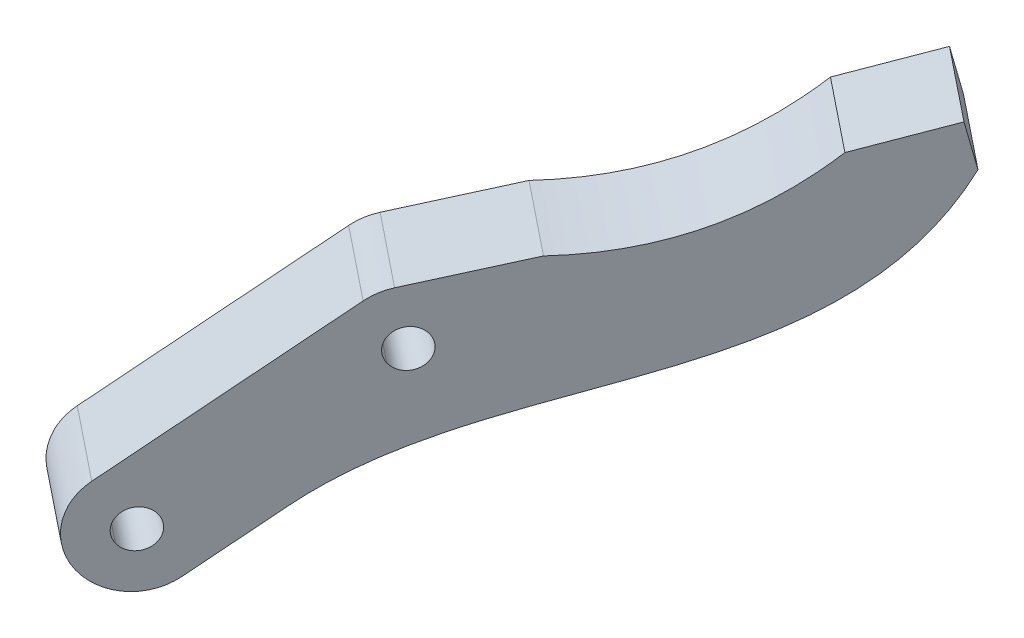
ISO-10303-21;
HEADER;
FILE_DESCRIPTION(('STEP AP214'),'2;1');
FILE_NAME('part.step','',(''),(''),'','','');
FILE_SCHEMA(('AUTOMOTIVE_DESIGN { 1 0 10303 214 1 1 1 1 }'));
ENDSEC;
DATA;
#1=APPLICATION_CONTEXT('core data for automotive mechanical design processes');
#2=APPLICATION_PROTOCOL_DEFINITION('international standard','automotive_design',2000,#1);
#3=PRODUCT_CONTEXT('',#1,'mechanical');
#4=PRODUCT('Part','Part','',(#3));
#5=PRODUCT_RELATED_PRODUCT_CATEGORY('part','',(#4));
#6=PRODUCT_DEFINITION_FORMATION('','',#4);
#7=PRODUCT_DEFINITION_CONTEXT('part definition',#1,'design');
#8=PRODUCT_DEFINITION('design','',#6,#7);
#9=PRODUCT_DEFINITION_SHAPE('','',#8);
#10=(LENGTH_UNIT() NAMED_UNIT(*) SI_UNIT(.MILLI.,.METRE.));
#11=(NAMED_UNIT(*) PLANE_ANGLE_UNIT() SI_UNIT($,.RADIAN.));
#12=(NAMED_UNIT(*) SI_UNIT($,.STERADIAN.) SOLID_ANGLE_UNIT());
#13=UNCERTAINTY_MEASURE_WITH_UNIT(LENGTH_MEASURE(1.E-05),#10,'distance_accuracy_value','');
#14=(GEOMETRIC_REPRESENTATION_CONTEXT(3) GLOBAL_UNCERTAINTY_ASSIGNED_CONTEXT((#13)) GLOBAL_UNIT_ASSIGNED_CONTEXT((#10,
#11,#12)) REPRESENTATION_CONTEXT('',''));
#15=CARTESIAN_POINT('',(0.,0.,0.));
#16=DIRECTION('',(0.,0.,1.));
#17=DIRECTION('',(1.,0.,0.));
#18=AXIS2_PLACEMENT_3D('',#15,#16,#17);
#19=CARTESIAN_POINT('',(239.431291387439,-64.0616310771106,155.644852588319));
#20=CARTESIAN_POINT('',(232.792104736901,-64.0241873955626,150.337329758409));
#21=CARTESIAN_POINT('',(233.603203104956,-81.6090432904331,162.811421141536));
#22=CARTESIAN_POINT('',(226.964016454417,-81.5715996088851,157.503898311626));
#23=CARTESIAN_POINT('',(220.015722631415,-77.0413137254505,179.840241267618));
#24=CARTESIAN_POINT('',(213.376535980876,-77.0038700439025,174.532718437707));
#25=CARTESIAN_POINT('',(211.23567759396,-87.3072541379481,190.750785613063));
#26=CARTESIAN_POINT('',(204.596490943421,-87.2698104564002,185.443262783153));
#27=(BOUNDED_SURFACE() B_SPLINE_SURFACE(3,1,((#19,#20),(#21,#22),(#23,#24),(#25,#26)),
.UNSPECIFIED.,.F.,.F.,.F.) B_SPLINE_SURFACE_WITH_KNOTS((4,4),(2,2),(0.,1.),(0.,1.),
.UNSPECIFIED.) GEOMETRIC_REPRESENTATION_ITEM() RATIONAL_B_SPLINE_SURFACE(((1.,1.),(1.,1.),(1.,
1.),(1.,1.))) REPRESENTATION_ITEM('') SURFACE());
#28=CARTESIAN_POINT('',(232.792104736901,-64.0241873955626,150.337329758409));
#29=CARTESIAN_POINT('',(226.964016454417,-81.5715996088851,157.503898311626));
#30=CARTESIAN_POINT('',(213.376535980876,-77.0038700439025,174.532718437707));
#31=CARTESIAN_POINT('',(204.596490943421,-87.2698104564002,185.443262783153));
#32=(BOUNDED_CURVE() B_SPLINE_CURVE(3,(#28,#29,#30,#31),.UNSPECIFIED.,.F.,
.F.) B_SPLINE_CURVE_WITH_KNOTS((4,4),(0.,1.),
.UNSPECIFIED.) CURVE() GEOMETRIC_REPRESENTATION_ITEM() RATIONAL_B_SPLINE_CURVE((1.,1.,1.,1.)) REPRESENTATION_ITEM(''));
#33=CARTESIAN_POINT('',(232.792104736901,-64.0241873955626,150.337329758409));
#34=VERTEX_POINT('',#33);
#35=CARTESIAN_POINT('',(204.596490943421,-87.2698104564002,185.443262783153));
#36=VERTEX_POINT('',#35);
#37=EDGE_CURVE('E292',#34,#36,#32,.T.);
#38=DIRECTION('',(-0.781080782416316,0.00440513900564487,-0.624414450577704));
#39=VECTOR('',#38,1.);
#40=CARTESIAN_POINT('',(239.431291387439,-64.0616310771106,155.644852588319));
#41=LINE('',#40,#39);
#42=CARTESIAN_POINT('',(239.431291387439,-64.0616310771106,155.644852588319));
#43=VERTEX_POINT('',#42);
#44=EDGE_CURVE('E189',#43,#34,#41,.T.);
#45=CARTESIAN_POINT('',(239.431291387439,-64.0616310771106,155.644852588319));
#46=CARTESIAN_POINT('',(233.603203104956,-81.6090432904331,162.811421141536));
#47=CARTESIAN_POINT('',(220.015722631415,-77.0413137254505,179.840241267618));
#48=CARTESIAN_POINT('',(211.23567759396,-87.3072541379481,190.750785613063));
#49=(BOUNDED_CURVE() B_SPLINE_CURVE(3,(#45,#46,#47,#48),.UNSPECIFIED.,.F.,
.F.) B_SPLINE_CURVE_WITH_KNOTS((4,4),(0.,1.),
.UNSPECIFIED.) CURVE() GEOMETRIC_REPRESENTATION_ITEM() RATIONAL_B_SPLINE_CURVE((1.,1.,1.,1.)) REPRESENTATION_ITEM(''));
#50=CARTESIAN_POINT('',(211.23567759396,-87.3072541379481,190.750785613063));
#51=VERTEX_POINT('',#50);
#52=EDGE_CURVE('E297',#43,#51,#49,.T.);
#53=DIRECTION('',(-0.781080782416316,0.00440513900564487,-0.624414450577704));
#54=VECTOR('',#53,1.);
#55=CARTESIAN_POINT('',(211.23567759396,-87.3072541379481,190.750785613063));
#56=LINE('',#55,#54);
#57=EDGE_CURVE('E246',#51,#36,#56,.T.);
#58=ORIENTED_EDGE('',*,*,#37,.F.);
#59=ORIENTED_EDGE('',*,*,#44,.F.);
#60=ORIENTED_EDGE('',*,*,#52,.T.);
#61=ORIENTED_EDGE('',*,*,#57,.T.);
#62=EDGE_LOOP('',(#58,#59,#60,#61));
#63=FACE_BOUND('',#62,.T.);
#64=ADVANCED_FACE('F17',(#63),#27,.T.);
#65=CARTESIAN_POINT('',(199.309984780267,-75.2439494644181,205.753753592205));
#66=DIRECTION('',(-0.108750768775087,0.98373318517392,0.142976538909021));
#67=DIRECTION('',(0.614887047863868,0.179581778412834,-0.767896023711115));
#68=AXIS2_PLACEMENT_3D('',#65,#66,#67);
#69=PLANE('',#68);
#70=DIRECTION('',(0.614887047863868,0.179581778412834,-0.767896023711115));
#71=VECTOR('',#70,1.);
#72=CARTESIAN_POINT('',(192.670798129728,-75.2065057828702,200.446230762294));
#73=LINE('',#72,#71);
#74=CARTESIAN_POINT('',(208.948301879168,-70.4525544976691,180.118220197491));
#75=VERTEX_POINT('',#74);
#76=CARTESIAN_POINT('',(215.032810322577,-68.6755340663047,172.519637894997));
#77=VERTEX_POINT('',#76);
#78=EDGE_CURVE('E191',#75,#77,#73,.T.);
#79=ORIENTED_EDGE('',*,*,#78,.F.);
#80=DIRECTION('',(-0.781080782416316,0.00440513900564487,-0.624414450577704));
#81=VECTOR('',#80,1.);
#82=CARTESIAN_POINT('',(215.587488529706,-70.4899981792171,185.425743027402));
#83=LINE('',#82,#81);
#84=CARTESIAN_POINT('',(215.587488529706,-70.4899981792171,185.425743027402));
#85=VERTEX_POINT('',#84);
#86=EDGE_CURVE('E201',#85,#75,#83,.T.);
#87=ORIENTED_EDGE('',*,*,#86,.F.);
#88=DIRECTION('',(0.614887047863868,0.179581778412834,-0.767896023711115));
#89=VECTOR('',#88,1.);
#90=CARTESIAN_POINT('',(199.309984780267,-75.2439494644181,205.753753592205));
#91=LINE('',#90,#89);
#92=CARTESIAN_POINT('',(221.671996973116,-68.7129777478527,177.827160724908));
#93=VERTEX_POINT('',#92);
#94=EDGE_CURVE('E320',#85,#93,#91,.T.);
#95=ORIENTED_EDGE('',*,*,#94,.T.);
#96=DIRECTION('',(-0.781080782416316,0.00440513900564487,-0.624414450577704));
#97=VECTOR('',#96,1.);
#98=CARTESIAN_POINT('',(221.671996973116,-68.7129777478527,177.827160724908));
#99=LINE('',#98,#97);
#100=EDGE_CURVE('E10',#93,#77,#99,.T.);
#101=ORIENTED_EDGE('',*,*,#100,.T.);
#102=EDGE_LOOP('',(#79,#87,#95,#101));
#103=FACE_BOUND('',#102,.T.);
#104=ADVANCED_FACE('F19',(#103),#69,.T.);
#105=CARTESIAN_POINT('',(221.671996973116,-68.7129777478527,177.827160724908));
#106=CARTESIAN_POINT('',(215.032810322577,-68.6755340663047,172.519637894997));
#107=CARTESIAN_POINT('',(228.667968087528,-69.2652196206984,169.071996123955));
#108=CARTESIAN_POINT('',(222.028781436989,-69.2277759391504,163.764473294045));
#109=CARTESIAN_POINT('',(234.002933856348,-62.0056545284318,162.449696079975));
#110=CARTESIAN_POINT('',(227.363747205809,-61.9682108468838,157.142173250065));
#111=(BOUNDED_SURFACE() B_SPLINE_SURFACE(2,1,((#105,#106),(#107,#108),(#109,#110)),
.UNSPECIFIED.,.F.,.F.,.F.) B_SPLINE_SURFACE_WITH_KNOTS((3,3),(2,2),(0.,1.),(0.,1.),
.UNSPECIFIED.) GEOMETRIC_REPRESENTATION_ITEM() RATIONAL_B_SPLINE_SURFACE(((1.,1.),(1.,1.),(1.,1.))) REPRESENTATION_ITEM('') SURFACE());
#112=CARTESIAN_POINT('',(215.032810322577,-68.6755340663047,172.519637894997));
#113=CARTESIAN_POINT('',(222.028781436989,-69.2277759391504,163.764473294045));
#114=CARTESIAN_POINT('',(227.363747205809,-61.9682108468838,157.142173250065));
#115=(BOUNDED_CURVE() B_SPLINE_CURVE(2,(#112,#113,#114),.UNSPECIFIED.,.F.,
.F.) B_SPLINE_CURVE_WITH_KNOTS((3,3),(0.,1.),
.UNSPECIFIED.) CURVE() GEOMETRIC_REPRESENTATION_ITEM() RATIONAL_B_SPLINE_CURVE((1.,1.,1.)) REPRESENTATION_ITEM(''));
#116=CARTESIAN_POINT('',(227.363747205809,-61.9682108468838,157.142173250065));
#117=VERTEX_POINT('',#116);
#118=EDGE_CURVE('E195',#77,#117,#115,.T.);
#119=CARTESIAN_POINT('',(221.671996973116,-68.7129777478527,177.827160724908));
#120=CARTESIAN_POINT('',(228.667968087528,-69.2652196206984,169.071996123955));
#121=CARTESIAN_POINT('',(234.002933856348,-62.0056545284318,162.449696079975));
#122=(BOUNDED_CURVE() B_SPLINE_CURVE(2,(#119,#120,#121),.UNSPECIFIED.,.F.,
.F.) B_SPLINE_CURVE_WITH_KNOTS((3,3),(0.,1.),
.UNSPECIFIED.) CURVE() GEOMETRIC_REPRESENTATION_ITEM() RATIONAL_B_SPLINE_CURVE((1.,1.,1.)) REPRESENTATION_ITEM(''));
#123=CARTESIAN_POINT('',(234.002933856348,-62.0056545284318,162.449696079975));
#124=VERTEX_POINT('',#123);
#125=EDGE_CURVE('E315',#93,#124,#122,.T.);
#126=DIRECTION('',(-0.781080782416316,0.00440513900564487,-0.624414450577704));
#127=VECTOR('',#126,1.);
#128=CARTESIAN_POINT('',(234.002933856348,-62.0056545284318,162.449696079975));
#129=LINE('',#128,#127);
#130=EDGE_CURVE('E26',#124,#117,#129,.T.);
#131=ORIENTED_EDGE('',*,*,#118,.F.);
#132=ORIENTED_EDGE('',*,*,#100,.F.);
#133=ORIENTED_EDGE('',*,*,#125,.T.);
#134=ORIENTED_EDGE('',*,*,#130,.T.);
#135=EDGE_LOOP('',(#131,#132,#133,#134));
#136=FACE_BOUND('',#135,.T.);
#137=ADVANCED_FACE('F368',(#136),#111,.T.);
#138=CARTESIAN_POINT('',(198.907540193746,-75.2494675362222,206.257133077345));
#139=DIRECTION('',(-0.140042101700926,0.973266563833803,0.182045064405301));
#140=DIRECTION('',(0.60852364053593,0.229636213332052,-0.759582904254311));
#141=AXIS2_PLACEMENT_3D('',#138,#139,#140);
#142=PLANE('',#141);
#143=DIRECTION('',(0.60852364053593,0.229636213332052,-0.759582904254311));
#144=VECTOR('',#143,1.);
#145=CARTESIAN_POINT('',(192.268353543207,-75.2120238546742,200.949610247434));
#146=LINE('',#145,#144);
#147=CARTESIAN_POINT('',(232.231936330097,-60.1311211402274,151.06551001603));
#148=VERTEX_POINT('',#147);
#149=EDGE_CURVE('E259',#117,#148,#146,.T.);
#150=ORIENTED_EDGE('',*,*,#149,.F.);
#151=ORIENTED_EDGE('',*,*,#130,.F.);
#152=DIRECTION('',(0.60852364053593,0.229636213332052,-0.759582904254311));
#153=VECTOR('',#152,1.);
#154=CARTESIAN_POINT('',(198.907540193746,-75.2494675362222,206.257133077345));
#155=LINE('',#154,#153);
#156=CARTESIAN_POINT('',(238.871122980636,-60.1685648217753,156.373032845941));
#157=VERTEX_POINT('',#156);
#158=EDGE_CURVE('E312',#124,#157,#155,.T.);
#159=ORIENTED_EDGE('',*,*,#158,.T.);
#160=DIRECTION('',(-0.781080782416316,0.00440513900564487,-0.624414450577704));
#161=VECTOR('',#160,1.);
#162=CARTESIAN_POINT('',(238.871122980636,-60.1685648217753,156.373032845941));
#163=LINE('',#162,#161);
#164=EDGE_CURVE('E326',#157,#148,#163,.T.);
#165=ORIENTED_EDGE('',*,*,#164,.T.);
#166=EDGE_LOOP('',(#150,#151,#159,#165));
#167=FACE_BOUND('',#166,.T.);
#168=ADVANCED_FACE('F341',(#167),#142,.T.);
#169=CARTESIAN_POINT('',(240.610641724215,-72.2578965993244,154.111778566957));
#170=DIRECTION('',(0.60852364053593,0.229636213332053,-0.759582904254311));
#171=DIRECTION('',(0.781080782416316,-0.00440513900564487,0.624414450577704));
#172=AXIS2_PLACEMENT_3D('',#169,#170,#171);
#173=PLANE('',#172);
#174=DIRECTION('',(0.140042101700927,-0.973266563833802,-0.182045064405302));
#175=VECTOR('',#174,1.);
#176=CARTESIAN_POINT('',(233.971455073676,-72.2204529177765,148.804255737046));
#177=LINE('',#176,#175);
#178=EDGE_CURVE('E263',#148,#34,#177,.T.);
#179=ORIENTED_EDGE('',*,*,#178,.F.);
#180=ORIENTED_EDGE('',*,*,#164,.F.);
#181=DIRECTION('',(0.140042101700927,-0.973266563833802,-0.182045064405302));
#182=VECTOR('',#181,1.);
#183=CARTESIAN_POINT('',(240.610641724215,-72.2578965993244,154.111778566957));
#184=LINE('',#183,#182);
#185=EDGE_CURVE('E305',#157,#43,#184,.T.);
#186=ORIENTED_EDGE('',*,*,#185,.T.);
#187=ORIENTED_EDGE('',*,*,#44,.T.);
#188=EDGE_LOOP('',(#179,#180,#186,#187));
#189=FACE_BOUND('',#188,.T.);
#190=ADVANCED_FACE('F334',(#189),#173,.T.);
#191=CARTESIAN_POINT('',(200.647058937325,-87.3387993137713,203.995878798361));
#192=DIRECTION('',(-0.781080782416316,0.00440513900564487,-0.624414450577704));
#193=DIRECTION('',(0.366392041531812,-0.806505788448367,-0.464010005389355));
#194=AXIS2_PLACEMENT_3D('',#191,#192,#193);
#195=PLANE('',#194);
#196=CARTESIAN_POINT('',(216.131242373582,-75.4086641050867,184.710860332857));
#197=DIRECTION('',(-0.781080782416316,0.00440513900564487,-0.624414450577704));
#198=DIRECTION('',(0.505637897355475,0.591209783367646,-0.628332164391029));
#199=AXIS2_PLACEMENT_3D('',#196,#197,#198);
#200=CIRCLE('',#199,1.75);
#201=CARTESIAN_POINT('',(215.24637605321,-76.4432812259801,185.810441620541));
#202=VERTEX_POINT('',#201);
#203=CARTESIAN_POINT('',(217.016108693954,-74.3740469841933,183.611279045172));
#204=VERTEX_POINT('',#203);
#205=EDGE_CURVE('E172',#202,#204,#200,.T.);
#206=ORIENTED_EDGE('',*,*,#205,.T.);
#207=CARTESIAN_POINT('',(216.131242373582,-75.4086641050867,184.710860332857));
#208=DIRECTION('',(-0.781080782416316,0.00440513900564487,-0.624414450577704));
#209=DIRECTION('',(0.505637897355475,0.591209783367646,-0.628332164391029));
#210=AXIS2_PLACEMENT_3D('',#207,#208,#209);
#211=CIRCLE('',#210,1.75);
#212=EDGE_CURVE('E165',#204,#202,#211,.T.);
#213=ORIENTED_EDGE('',*,*,#212,.T.);
#214=EDGE_LOOP('',(#206,#213));
#215=FACE_BOUND('',#214,.T.);
#216=CARTESIAN_POINT('',(205.007208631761,-88.4152793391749,198.534167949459));
#217=DIRECTION('',(-0.781080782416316,0.00440513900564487,-0.624414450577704));
#218=DIRECTION('',(0.505637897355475,0.591209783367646,-0.628332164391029));
#219=AXIS2_PLACEMENT_3D('',#216,#217,#218);
#220=CIRCLE('',#219,1.75);
#221=CARTESIAN_POINT('',(204.122342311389,-89.4498964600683,199.633749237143));
#222=VERTEX_POINT('',#221);
#223=CARTESIAN_POINT('',(205.892074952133,-87.3806622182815,197.434586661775));
#224=VERTEX_POINT('',#223);
#225=EDGE_CURVE('E220',#222,#224,#220,.T.);
#226=ORIENTED_EDGE('',*,*,#225,.T.);
#227=CARTESIAN_POINT('',(205.007208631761,-88.4152793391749,198.534167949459));
#228=DIRECTION('',(-0.781080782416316,0.00440513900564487,-0.624414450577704));
#229=DIRECTION('',(0.505637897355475,0.591209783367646,-0.628332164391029));
#230=AXIS2_PLACEMENT_3D('',#227,#228,#229);
#231=CIRCLE('',#230,1.75);
#232=EDGE_CURVE('E166',#224,#222,#231,.T.);
#233=ORIENTED_EDGE('',*,*,#232,.T.);
#234=EDGE_LOOP('',(#226,#233));
#235=FACE_BOUND('',#234,.T.);
#236=DIRECTION('',(0.505637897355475,0.591209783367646,-0.628332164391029));
#237=VECTOR('',#236,1.);
#238=CARTESIAN_POINT('',(204.310979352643,-95.403857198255,199.355778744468));
#239=LINE('',#238,#237);
#240=CARTESIAN_POINT('',(206.83916883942,-92.4478082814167,196.214117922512));
#241=VERTEX_POINT('',#240);
#242=EDGE_CURVE('E250',#241,#51,#239,.T.);
#243=ORIENTED_EDGE('',*,*,#242,.T.);
#244=ORIENTED_EDGE('',*,*,#52,.F.);
#245=ORIENTED_EDGE('',*,*,#185,.F.);
#246=ORIENTED_EDGE('',*,*,#158,.F.);
#247=ORIENTED_EDGE('',*,*,#125,.F.);
#248=ORIENTED_EDGE('',*,*,#94,.F.);
#249=CARTESIAN_POINT('',(216.131242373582,-75.4086641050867,184.710860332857));
#250=DIRECTION('',(-0.781080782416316,0.00440513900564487,-0.624414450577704));
#251=DIRECTION('',(0.505637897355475,0.591209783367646,-0.628332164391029));
#252=AXIS2_PLACEMENT_3D('',#249,#250,#251);
#253=CIRCLE('',#252,5.);
#254=CARTESIAN_POINT('',(214.299282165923,-71.3761351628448,187.030910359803));
#255=VERTEX_POINT('',#254);
#256=EDGE_CURVE('E187',#255,#85,#253,.T.);
#257=ORIENTED_EDGE('',*,*,#256,.F.);
#258=DIRECTION('',(0.505637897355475,0.591209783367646,-0.628332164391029));
#259=VECTOR('',#258,1.);
#260=CARTESIAN_POINT('',(200.647058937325,-87.3387993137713,203.995878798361));
#261=LINE('',#260,#259);
#262=CARTESIAN_POINT('',(203.175248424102,-84.382750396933,200.854217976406));
#263=VERTEX_POINT('',#262);
#264=EDGE_CURVE('E225',#263,#255,#261,.T.);
#265=ORIENTED_EDGE('',*,*,#264,.F.);
#266=CARTESIAN_POINT('',(205.007208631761,-88.4152793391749,198.534167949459));
#267=DIRECTION('',(-0.781080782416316,0.00440513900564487,-0.624414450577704));
#268=DIRECTION('',(0.505637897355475,0.591209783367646,-0.628332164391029));
#269=AXIS2_PLACEMENT_3D('',#266,#267,#268);
#270=CIRCLE('',#269,5.);
#271=CARTESIAN_POINT('',(202.479019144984,-91.3713282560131,201.675828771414));
#272=VERTEX_POINT('',#271);
#273=EDGE_CURVE('E202',#272,#263,#270,.T.);
#274=ORIENTED_EDGE('',*,*,#273,.F.);
#275=CARTESIAN_POINT('',(205.007208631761,-88.4152793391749,198.534167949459));
#276=DIRECTION('',(-0.781080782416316,0.00440513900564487,-0.624414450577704));
#277=DIRECTION('',(0.505637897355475,0.591209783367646,-0.628332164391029));
#278=AXIS2_PLACEMENT_3D('',#275,#276,#277);
#279=CIRCLE('',#278,5.);
#280=EDGE_CURVE('E270',#241,#272,#279,.T.);
#281=ORIENTED_EDGE('',*,*,#280,.F.);
#282=EDGE_LOOP('',(#243,#244,#245,#246,#247,#248,#257,#265,#274,#281));
#283=FACE_BOUND('',#282,.T.);
#284=ADVANCED_FACE('F345',(#215,#235,#283),#195,.F.);
#285=CARTESIAN_POINT('',(194.007872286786,-87.3013556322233,198.688355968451));
#286=DIRECTION('',(-0.781080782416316,0.00440513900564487,-0.624414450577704));
#287=DIRECTION('',(0.366392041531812,-0.806505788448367,-0.464010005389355));
#288=AXIS2_PLACEMENT_3D('',#285,#286,#287);
#289=PLANE('',#288);
#290=CARTESIAN_POINT('',(209.492055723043,-75.3712204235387,179.403337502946));
#291=DIRECTION('',(-0.781080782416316,0.00440513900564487,-0.624414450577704));
#292=DIRECTION('',(0.505637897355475,0.591209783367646,-0.628332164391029));
#293=AXIS2_PLACEMENT_3D('',#290,#291,#292);
#294=CIRCLE('',#293,1.75);
#295=CARTESIAN_POINT('',(208.607189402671,-76.4058375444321,180.50291879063));
#296=VERTEX_POINT('',#295);
#297=CARTESIAN_POINT('',(210.376922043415,-74.3366033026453,178.303756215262));
#298=VERTEX_POINT('',#297);
#299=EDGE_CURVE('E170',#296,#298,#294,.T.);
#300=ORIENTED_EDGE('',*,*,#299,.F.);
#301=CARTESIAN_POINT('',(209.492055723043,-75.3712204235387,179.403337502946));
#302=DIRECTION('',(-0.781080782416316,0.00440513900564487,-0.624414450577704));
#303=DIRECTION('',(0.505637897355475,0.591209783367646,-0.628332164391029));
#304=AXIS2_PLACEMENT_3D('',#301,#302,#303);
#305=CIRCLE('',#304,1.75);
#306=EDGE_CURVE('E154',#298,#296,#305,.T.);
#307=ORIENTED_EDGE('',*,*,#306,.F.);
#308=EDGE_LOOP('',(#300,#307));
#309=FACE_BOUND('',#308,.T.);
#310=CARTESIAN_POINT('',(198.368021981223,-88.3778356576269,193.226645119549));
#311=DIRECTION('',(-0.781080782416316,0.00440513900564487,-0.624414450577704));
#312=DIRECTION('',(0.505637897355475,0.591209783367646,-0.628332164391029));
#313=AXIS2_PLACEMENT_3D('',#310,#311,#312);
#314=CIRCLE('',#313,1.75);
#315=CARTESIAN_POINT('',(197.48315566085,-89.4124527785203,194.326226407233));
#316=VERTEX_POINT('',#315);
#317=CARTESIAN_POINT('',(199.252888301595,-87.3432185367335,192.127063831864));
#318=VERTEX_POINT('',#317);
#319=EDGE_CURVE('E174',#316,#318,#314,.T.);
#320=ORIENTED_EDGE('',*,*,#319,.F.);
#321=CARTESIAN_POINT('',(198.368021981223,-88.3778356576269,193.226645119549));
#322=DIRECTION('',(-0.781080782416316,0.00440513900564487,-0.624414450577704));
#323=DIRECTION('',(0.505637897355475,0.591209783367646,-0.628332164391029));
#324=AXIS2_PLACEMENT_3D('',#321,#322,#323);
#325=CIRCLE('',#324,1.75);
#326=EDGE_CURVE('E224',#318,#316,#325,.T.);
#327=ORIENTED_EDGE('',*,*,#326,.F.);
#328=EDGE_LOOP('',(#320,#327));
#329=FACE_BOUND('',#328,.T.);
#330=DIRECTION('',(0.505637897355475,0.591209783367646,-0.628332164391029));
#331=VECTOR('',#330,1.);
#332=CARTESIAN_POINT('',(197.671792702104,-95.366413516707,194.048255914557));
#333=LINE('',#332,#331);
#334=CARTESIAN_POINT('',(200.199982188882,-92.4103645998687,190.906595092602));
#335=VERTEX_POINT('',#334);
#336=EDGE_CURVE('E258',#335,#36,#333,.T.);
#337=ORIENTED_EDGE('',*,*,#336,.F.);
#338=CARTESIAN_POINT('',(198.368021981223,-88.3778356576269,193.226645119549));
#339=DIRECTION('',(-0.781080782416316,0.00440513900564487,-0.624414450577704));
#340=DIRECTION('',(0.505637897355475,0.591209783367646,-0.628332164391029));
#341=AXIS2_PLACEMENT_3D('',#338,#339,#340);
#342=CIRCLE('',#341,5.);
#343=CARTESIAN_POINT('',(195.839832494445,-91.3338845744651,196.368305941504));
#344=VERTEX_POINT('',#343);
#345=EDGE_CURVE('E267',#335,#344,#342,.T.);
#346=ORIENTED_EDGE('',*,*,#345,.T.);
#347=CARTESIAN_POINT('',(198.368021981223,-88.3778356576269,193.226645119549));
#348=DIRECTION('',(-0.781080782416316,0.00440513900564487,-0.624414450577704));
#349=DIRECTION('',(0.505637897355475,0.591209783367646,-0.628332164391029));
#350=AXIS2_PLACEMENT_3D('',#347,#348,#349);
#351=CIRCLE('',#350,5.);
#352=CARTESIAN_POINT('',(196.536061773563,-84.3453067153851,195.546695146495));
#353=VERTEX_POINT('',#352);
#354=EDGE_CURVE('E232',#344,#353,#351,.T.);
#355=ORIENTED_EDGE('',*,*,#354,.T.);
#356=DIRECTION('',(0.505637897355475,0.591209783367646,-0.628332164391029));
#357=VECTOR('',#356,1.);
#358=CARTESIAN_POINT('',(194.007872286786,-87.3013556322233,198.688355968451));
#359=LINE('',#358,#357);
#360=CARTESIAN_POINT('',(207.660095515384,-71.3386914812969,181.723387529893));
#361=VERTEX_POINT('',#360);
#362=EDGE_CURVE('E221',#353,#361,#359,.T.);
#363=ORIENTED_EDGE('',*,*,#362,.T.);
#364=CARTESIAN_POINT('',(209.492055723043,-75.3712204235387,179.403337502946));
#365=DIRECTION('',(-0.781080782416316,0.00440513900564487,-0.624414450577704));
#366=DIRECTION('',(0.505637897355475,0.591209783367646,-0.628332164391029));
#367=AXIS2_PLACEMENT_3D('',#364,#365,#366);
#368=CIRCLE('',#367,5.);
#369=EDGE_CURVE('E208',#361,#75,#368,.T.);
#370=ORIENTED_EDGE('',*,*,#369,.T.);
#371=ORIENTED_EDGE('',*,*,#78,.T.);
#372=ORIENTED_EDGE('',*,*,#118,.T.);
#373=ORIENTED_EDGE('',*,*,#149,.T.);
#374=ORIENTED_EDGE('',*,*,#178,.T.);
#375=ORIENTED_EDGE('',*,*,#37,.T.);
#376=EDGE_LOOP('',(#337,#346,#355,#363,#370,#371,#372,#373,#374,#375));
#377=FACE_BOUND('',#376,.T.);
#378=ADVANCED_FACE('F176',(#309,#329,#377),#289,.T.);
#379=CARTESIAN_POINT('',(209.492055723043,-75.3712204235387,179.403337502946));
#380=DIRECTION('',(0.781080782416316,-0.00440513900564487,0.624414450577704));
#381=DIRECTION('',(-0.505637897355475,-0.591209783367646,0.628332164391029));
#382=AXIS2_PLACEMENT_3D('',#379,#380,#381);
#383=CYLINDRICAL_SURFACE('',#382,1.75);
#384=DIRECTION('',(0.781080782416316,-0.00440513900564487,0.624414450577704));
#385=VECTOR('',#384,1.);
#386=CARTESIAN_POINT('',(210.376922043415,-74.3366033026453,178.303756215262));
#387=LINE('',#386,#385);
#388=EDGE_CURVE('E160',#298,#204,#387,.T.);
#389=ORIENTED_EDGE('',*,*,#388,.F.);
#390=ORIENTED_EDGE('',*,*,#306,.T.);
#391=DIRECTION('',(0.781080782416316,-0.00440513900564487,0.624414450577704));
#392=VECTOR('',#391,1.);
#393=CARTESIAN_POINT('',(208.607189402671,-76.4058375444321,180.50291879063));
#394=LINE('',#393,#392);
#395=EDGE_CURVE('E157',#296,#202,#394,.T.);
#396=ORIENTED_EDGE('',*,*,#395,.T.);
#397=ORIENTED_EDGE('',*,*,#212,.F.);
#398=EDGE_LOOP('',(#389,#390,#396,#397));
#399=FACE_BOUND('',#398,.T.);
#400=ADVANCED_FACE('F156',(#399),#383,.F.);
#401=CARTESIAN_POINT('',(198.368021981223,-88.3778356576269,193.226645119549));
#402=DIRECTION('',(0.781080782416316,-0.00440513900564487,0.624414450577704));
#403=DIRECTION('',(-0.505637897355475,-0.591209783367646,0.628332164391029));
#404=AXIS2_PLACEMENT_3D('',#401,#402,#403);
#405=CYLINDRICAL_SURFACE('',#404,1.75);
#406=DIRECTION('',(0.781080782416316,-0.00440513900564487,0.624414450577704));
#407=VECTOR('',#406,1.);
#408=CARTESIAN_POINT('',(199.252888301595,-87.3432185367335,192.127063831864));
#409=LINE('',#408,#407);
#410=EDGE_CURVE('E207',#318,#224,#409,.T.);
#411=ORIENTED_EDGE('',*,*,#410,.F.);
#412=ORIENTED_EDGE('',*,*,#326,.T.);
#413=DIRECTION('',(0.781080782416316,-0.00440513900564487,0.624414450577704));
#414=VECTOR('',#413,1.);
#415=CARTESIAN_POINT('',(197.48315566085,-89.4124527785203,194.326226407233));
#416=LINE('',#415,#414);
#417=EDGE_CURVE('E236',#316,#222,#416,.T.);
#418=ORIENTED_EDGE('',*,*,#417,.T.);
#419=ORIENTED_EDGE('',*,*,#232,.F.);
#420=EDGE_LOOP('',(#411,#412,#418,#419));
#421=FACE_BOUND('',#420,.T.);
#422=ADVANCED_FACE('F601',(#421),#405,.F.);
#423=CARTESIAN_POINT('',(194.007872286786,-87.3013556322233,198.688355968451));
#424=DIRECTION('',(0.366392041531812,-0.806505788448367,-0.464010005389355));
#425=DIRECTION('',(-0.781080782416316,0.00440513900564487,-0.624414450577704));
#426=AXIS2_PLACEMENT_3D('',#423,#424,#425);
#427=PLANE('',#426);
#428=ORIENTED_EDGE('',*,*,#264,.T.);
#429=DIRECTION('',(0.781080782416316,-0.00440513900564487,0.624414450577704));
#430=VECTOR('',#429,1.);
#431=CARTESIAN_POINT('',(207.660095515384,-71.3386914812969,181.723387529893));
#432=LINE('',#431,#430);
#433=EDGE_CURVE('E212',#361,#255,#432,.T.);
#434=ORIENTED_EDGE('',*,*,#433,.F.);
#435=ORIENTED_EDGE('',*,*,#362,.F.);
#436=DIRECTION('',(0.781080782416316,-0.00440513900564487,0.624414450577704));
#437=VECTOR('',#436,1.);
#438=CARTESIAN_POINT('',(196.536061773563,-84.3453067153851,195.546695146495));
#439=LINE('',#438,#437);
#440=EDGE_CURVE('E198',#353,#263,#439,.T.);
#441=ORIENTED_EDGE('',*,*,#440,.T.);
#442=EDGE_LOOP('',(#428,#434,#435,#441));
#443=FACE_BOUND('',#442,.T.);
#444=ADVANCED_FACE('F359',(#443),#427,.F.);
#445=CARTESIAN_POINT('',(198.368021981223,-88.3778356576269,193.226645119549));
#446=DIRECTION('',(0.781080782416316,-0.00440513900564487,0.624414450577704));
#447=DIRECTION('',(-0.505637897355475,-0.591209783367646,0.628332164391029));
#448=AXIS2_PLACEMENT_3D('',#445,#446,#447);
#449=CYLINDRICAL_SURFACE('',#448,5.);
#450=DIRECTION('',(0.781080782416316,-0.00440513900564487,0.624414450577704));
#451=VECTOR('',#450,1.);
#452=CARTESIAN_POINT('',(195.839832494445,-91.3338845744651,196.368305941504));
#453=LINE('',#452,#451);
#454=EDGE_CURVE('E216',#344,#272,#453,.T.);
#455=ORIENTED_EDGE('',*,*,#454,.F.);
#456=ORIENTED_EDGE('',*,*,#345,.F.);
#457=DIRECTION('',(0.781080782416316,-0.00440513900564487,0.624414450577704));
#458=VECTOR('',#457,1.);
#459=CARTESIAN_POINT('',(200.199982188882,-92.4103645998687,190.906595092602));
#460=LINE('',#459,#458);
#461=EDGE_CURVE('E254',#335,#241,#460,.T.);
#462=ORIENTED_EDGE('',*,*,#461,.T.);
#463=ORIENTED_EDGE('',*,*,#280,.T.);
#464=EDGE_LOOP('',(#455,#456,#462,#463));
#465=FACE_BOUND('',#464,.T.);
#466=ADVANCED_FACE('F354',(#465),#449,.T.);
#467=CARTESIAN_POINT('',(197.671792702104,-95.366413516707,194.048255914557));
#468=DIRECTION('',(0.366392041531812,-0.806505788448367,-0.464010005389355));
#469=DIRECTION('',(-0.781080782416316,0.00440513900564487,-0.624414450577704));
#470=AXIS2_PLACEMENT_3D('',#467,#468,#469);
#471=PLANE('',#470);
#472=ORIENTED_EDGE('',*,*,#57,.F.);
#473=ORIENTED_EDGE('',*,*,#242,.F.);
#474=ORIENTED_EDGE('',*,*,#461,.F.);
#475=ORIENTED_EDGE('',*,*,#336,.T.);
#476=EDGE_LOOP('',(#472,#473,#474,#475));
#477=FACE_BOUND('',#476,.T.);
#478=ADVANCED_FACE('F350',(#477),#471,.T.);
#479=CARTESIAN_POINT('',(209.492055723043,-75.3712204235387,179.403337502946));
#480=DIRECTION('',(0.781080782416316,-0.00440513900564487,0.624414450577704));
#481=DIRECTION('',(-0.505637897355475,-0.591209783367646,0.628332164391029));
#482=AXIS2_PLACEMENT_3D('',#479,#480,#481);
#483=CYLINDRICAL_SURFACE('',#482,5.);
#484=ORIENTED_EDGE('',*,*,#86,.T.);
#485=ORIENTED_EDGE('',*,*,#369,.F.);
#486=ORIENTED_EDGE('',*,*,#433,.T.);
#487=ORIENTED_EDGE('',*,*,#256,.T.);
#488=EDGE_LOOP('',(#484,#485,#486,#487));
#489=FACE_BOUND('',#488,.T.);
#490=ADVANCED_FACE('F366',(#489),#483,.T.);
#491=CARTESIAN_POINT('',(198.368021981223,-88.3778356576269,193.226645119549));
#492=DIRECTION('',(0.781080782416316,-0.00440513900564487,0.624414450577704));
#493=DIRECTION('',(-0.505637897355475,-0.591209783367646,0.628332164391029));
#494=AXIS2_PLACEMENT_3D('',#491,#492,#493);
#495=CYLINDRICAL_SURFACE('',#494,5.);
#496=ORIENTED_EDGE('',*,*,#354,.F.);
#497=ORIENTED_EDGE('',*,*,#454,.T.);
#498=ORIENTED_EDGE('',*,*,#273,.T.);
#499=ORIENTED_EDGE('',*,*,#440,.F.);
#500=EDGE_LOOP('',(#496,#497,#498,#499));
#501=FACE_BOUND('',#500,.T.);
#502=ADVANCED_FACE('F357',(#501),#495,.T.);
#503=CARTESIAN_POINT('',(198.368021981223,-88.3778356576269,193.226645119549));
#504=DIRECTION('',(0.781080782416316,-0.00440513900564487,0.624414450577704));
#505=DIRECTION('',(-0.505637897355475,-0.591209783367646,0.628332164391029));
#506=AXIS2_PLACEMENT_3D('',#503,#504,#505);
#507=CYLINDRICAL_SURFACE('',#506,1.75);
#508=ORIENTED_EDGE('',*,*,#319,.T.);
#509=ORIENTED_EDGE('',*,*,#410,.T.);
#510=ORIENTED_EDGE('',*,*,#225,.F.);
#511=ORIENTED_EDGE('',*,*,#417,.F.);
#512=EDGE_LOOP('',(#508,#509,#510,#511));
#513=FACE_BOUND('',#512,.T.);
#514=ADVANCED_FACE('F578',(#513),#507,.F.);
#515=CARTESIAN_POINT('',(209.492055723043,-75.3712204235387,179.403337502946));
#516=DIRECTION('',(0.781080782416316,-0.00440513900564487,0.624414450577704));
#517=DIRECTION('',(-0.505637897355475,-0.591209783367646,0.628332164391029));
#518=AXIS2_PLACEMENT_3D('',#515,#516,#517);
#519=CYLINDRICAL_SURFACE('',#518,1.75);
#520=ORIENTED_EDGE('',*,*,#299,.T.);
#521=ORIENTED_EDGE('',*,*,#388,.T.);
#522=ORIENTED_EDGE('',*,*,#205,.F.);
#523=ORIENTED_EDGE('',*,*,#395,.F.);
#524=EDGE_LOOP('',(#520,#521,#522,#523));
#525=FACE_BOUND('',#524,.T.);
#526=ADVANCED_FACE('F169',(#525),#519,.F.);
#527=CLOSED_SHELL('',(#64,#104,#137,#168,#190,#284,#378,#400,#422,#444,#466,#478,#490,#502,#514,#526));
#528=MANIFOLD_SOLID_BREP('B1',#527);
#529=ADVANCED_BREP_SHAPE_REPRESENTATION('',(#18,#528),#14);
#530=SHAPE_DEFINITION_REPRESENTATION(#9,#529);
ENDSEC;
END-ISO-10303-21;
